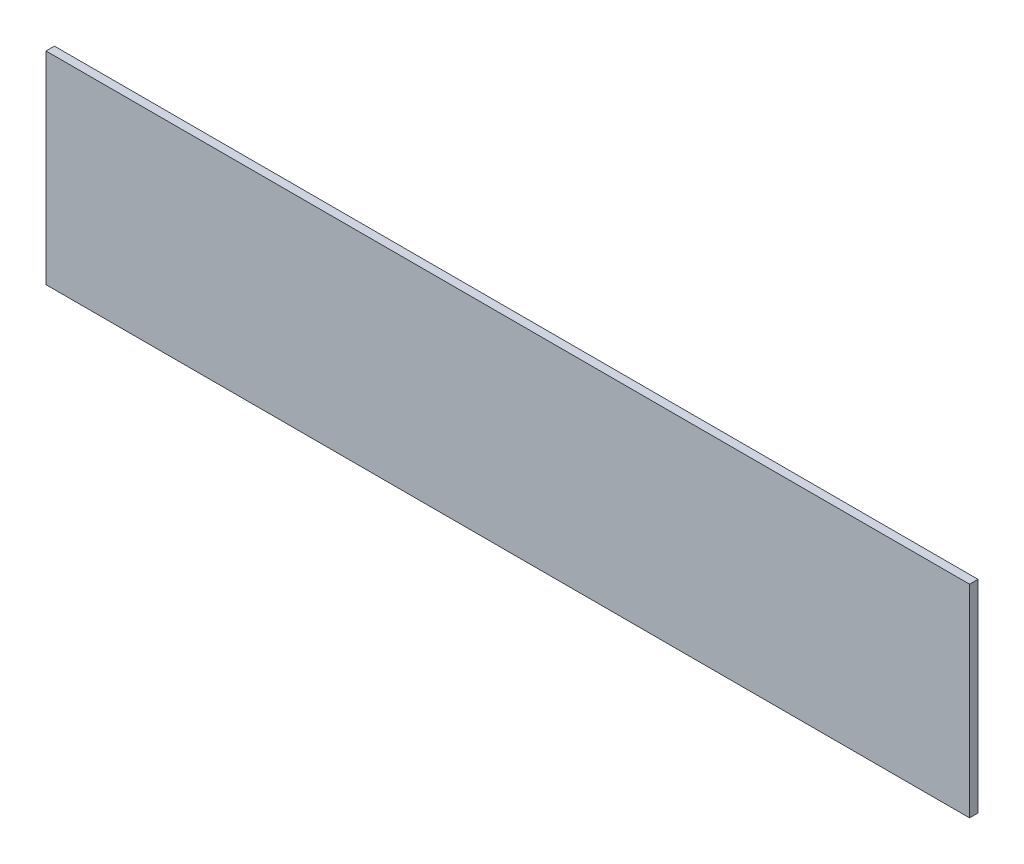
ISO-10303-21;
HEADER;
FILE_DESCRIPTION(('STEP AP214'),'2;1');
FILE_NAME('part.step','',(''),(''),'','','');
FILE_SCHEMA(('AUTOMOTIVE_DESIGN { 1 0 10303 214 1 1 1 1 }'));
ENDSEC;
DATA;
#1=APPLICATION_CONTEXT('core data for automotive mechanical design processes');
#2=APPLICATION_PROTOCOL_DEFINITION('international standard','automotive_design',2000,#1);
#3=PRODUCT_CONTEXT('',#1,'mechanical');
#4=PRODUCT('Part','Part','',(#3));
#5=PRODUCT_RELATED_PRODUCT_CATEGORY('part','',(#4));
#6=PRODUCT_DEFINITION_FORMATION('','',#4);
#7=PRODUCT_DEFINITION_CONTEXT('part definition',#1,'design');
#8=PRODUCT_DEFINITION('design','',#6,#7);
#9=PRODUCT_DEFINITION_SHAPE('','',#8);
#10=(LENGTH_UNIT() NAMED_UNIT(*) SI_UNIT(.MILLI.,.METRE.));
#11=(NAMED_UNIT(*) PLANE_ANGLE_UNIT() SI_UNIT($,.RADIAN.));
#12=(NAMED_UNIT(*) SI_UNIT($,.STERADIAN.) SOLID_ANGLE_UNIT());
#13=UNCERTAINTY_MEASURE_WITH_UNIT(LENGTH_MEASURE(1.E-05),#10,'distance_accuracy_value','');
#14=(GEOMETRIC_REPRESENTATION_CONTEXT(3) GLOBAL_UNCERTAINTY_ASSIGNED_CONTEXT((#13)) GLOBAL_UNIT_ASSIGNED_CONTEXT((#10,
#11,#12)) REPRESENTATION_CONTEXT('',''));
#15=CARTESIAN_POINT('',(0.,0.,0.));
#16=DIRECTION('',(0.,0.,1.));
#17=DIRECTION('',(1.,0.,0.));
#18=AXIS2_PLACEMENT_3D('',#15,#16,#17);
#19=CARTESIAN_POINT('',(0.,0.,6.00000000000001));
#20=DIRECTION('',(1.,0.,0.));
#21=DIRECTION('',(0.,0.,-1.));
#22=AXIS2_PLACEMENT_3D('',#19,#20,#21);
#23=PLANE('',#22);
#24=DIRECTION('',(0.,-1.,0.));
#25=VECTOR('',#24,1.);
#26=CARTESIAN_POINT('',(0.,0.,0.));
#27=LINE('',#26,#25);
#28=CARTESIAN_POINT('',(0.,144.,0.));
#29=VERTEX_POINT('',#28);
#30=CARTESIAN_POINT('',(0.,0.,0.));
#31=VERTEX_POINT('',#30);
#32=EDGE_CURVE('E85',#29,#31,#27,.T.);
#33=ORIENTED_EDGE('',*,*,#32,.T.);
#34=DIRECTION('',(0.,0.,-1.));
#35=VECTOR('',#34,1.);
#36=CARTESIAN_POINT('',(0.,0.,6.00000000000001));
#37=LINE('',#36,#35);
#38=CARTESIAN_POINT('',(0.,0.,6.00000000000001));
#39=VERTEX_POINT('',#38);
#40=EDGE_CURVE('E11',#39,#31,#37,.T.);
#41=ORIENTED_EDGE('',*,*,#40,.F.);
#42=DIRECTION('',(0.,-1.,0.));
#43=VECTOR('',#42,1.);
#44=CARTESIAN_POINT('',(0.,0.,6.00000000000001));
#45=LINE('',#44,#43);
#46=CARTESIAN_POINT('',(0.,144.,6.00000000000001));
#47=VERTEX_POINT('',#46);
#48=EDGE_CURVE('E103',#47,#39,#45,.T.);
#49=ORIENTED_EDGE('',*,*,#48,.F.);
#50=DIRECTION('',(0.,0.,-1.));
#51=VECTOR('',#50,1.);
#52=CARTESIAN_POINT('',(0.,144.,6.00000000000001));
#53=LINE('',#52,#51);
#54=EDGE_CURVE('E97',#47,#29,#53,.T.);
#55=ORIENTED_EDGE('',*,*,#54,.T.);
#56=EDGE_LOOP('',(#33,#41,#49,#55));
#57=FACE_BOUND('',#56,.T.);
#58=ADVANCED_FACE('F41',(#57),#23,.F.);
#59=CARTESIAN_POINT('',(0.,0.,6.00000000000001));
#60=DIRECTION('',(0.,1.,0.));
#61=DIRECTION('',(0.,0.,1.));
#62=AXIS2_PLACEMENT_3D('',#59,#60,#61);
#63=PLANE('',#62);
#64=DIRECTION('',(1.,0.,0.));
#65=VECTOR('',#64,1.);
#66=CARTESIAN_POINT('',(0.,0.,0.));
#67=LINE('',#66,#65);
#68=CARTESIAN_POINT('',(657.,0.,0.));
#69=VERTEX_POINT('',#68);
#70=EDGE_CURVE('E81',#31,#69,#67,.T.);
#71=ORIENTED_EDGE('',*,*,#70,.T.);
#72=DIRECTION('',(0.,0.,-1.));
#73=VECTOR('',#72,1.);
#74=CARTESIAN_POINT('',(657.,0.,6.00000000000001));
#75=LINE('',#74,#73);
#76=CARTESIAN_POINT('',(657.,0.,6.00000000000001));
#77=VERTEX_POINT('',#76);
#78=EDGE_CURVE('E48',#77,#69,#75,.T.);
#79=ORIENTED_EDGE('',*,*,#78,.F.);
#80=DIRECTION('',(1.,0.,0.));
#81=VECTOR('',#80,1.);
#82=CARTESIAN_POINT('',(0.,0.,6.00000000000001));
#83=LINE('',#82,#81);
#84=EDGE_CURVE('E93',#39,#77,#83,.T.);
#85=ORIENTED_EDGE('',*,*,#84,.F.);
#86=ORIENTED_EDGE('',*,*,#40,.T.);
#87=EDGE_LOOP('',(#71,#79,#85,#86));
#88=FACE_BOUND('',#87,.T.);
#89=ADVANCED_FACE('F92',(#88),#63,.F.);
#90=CARTESIAN_POINT('',(657.,0.,6.00000000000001));
#91=DIRECTION('',(-1.,0.,0.));
#92=DIRECTION('',(0.,0.,1.));
#93=AXIS2_PLACEMENT_3D('',#90,#91,#92);
#94=PLANE('',#93);
#95=DIRECTION('',(0.,1.,0.));
#96=VECTOR('',#95,1.);
#97=CARTESIAN_POINT('',(657.,0.,0.));
#98=LINE('',#97,#96);
#99=CARTESIAN_POINT('',(657.,144.,0.));
#100=VERTEX_POINT('',#99);
#101=EDGE_CURVE('E86',#69,#100,#98,.T.);
#102=ORIENTED_EDGE('',*,*,#101,.T.);
#103=DIRECTION('',(0.,0.,-1.));
#104=VECTOR('',#103,1.);
#105=CARTESIAN_POINT('',(657.,144.,6.00000000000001));
#106=LINE('',#105,#104);
#107=CARTESIAN_POINT('',(657.,144.,6.00000000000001));
#108=VERTEX_POINT('',#107);
#109=EDGE_CURVE('E109',#108,#100,#106,.T.);
#110=ORIENTED_EDGE('',*,*,#109,.F.);
#111=DIRECTION('',(0.,1.,0.));
#112=VECTOR('',#111,1.);
#113=CARTESIAN_POINT('',(657.,0.,6.00000000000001));
#114=LINE('',#113,#112);
#115=EDGE_CURVE('E60',#77,#108,#114,.T.);
#116=ORIENTED_EDGE('',*,*,#115,.F.);
#117=ORIENTED_EDGE('',*,*,#78,.T.);
#118=EDGE_LOOP('',(#102,#110,#116,#117));
#119=FACE_BOUND('',#118,.T.);
#120=ADVANCED_FACE('F112',(#119),#94,.F.);
#121=CARTESIAN_POINT('',(0.,144.,6.00000000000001));
#122=DIRECTION('',(0.,-1.,0.));
#123=DIRECTION('',(0.,0.,-1.));
#124=AXIS2_PLACEMENT_3D('',#121,#122,#123);
#125=PLANE('',#124);
#126=DIRECTION('',(-1.,0.,0.));
#127=VECTOR('',#126,1.);
#128=CARTESIAN_POINT('',(0.,144.,0.));
#129=LINE('',#128,#127);
#130=EDGE_CURVE('E101',#100,#29,#129,.T.);
#131=ORIENTED_EDGE('',*,*,#130,.T.);
#132=ORIENTED_EDGE('',*,*,#54,.F.);
#133=DIRECTION('',(-1.,0.,0.));
#134=VECTOR('',#133,1.);
#135=CARTESIAN_POINT('',(0.,144.,6.00000000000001));
#136=LINE('',#135,#134);
#137=EDGE_CURVE('E55',#108,#47,#136,.T.);
#138=ORIENTED_EDGE('',*,*,#137,.F.);
#139=ORIENTED_EDGE('',*,*,#109,.T.);
#140=EDGE_LOOP('',(#131,#132,#138,#139));
#141=FACE_BOUND('',#140,.T.);
#142=ADVANCED_FACE('F114',(#141),#125,.F.);
#143=CARTESIAN_POINT('',(0.,144.,6.00000000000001));
#144=DIRECTION('',(0.,0.,-1.));
#145=DIRECTION('',(-1.,0.,0.));
#146=AXIS2_PLACEMENT_3D('',#143,#144,#145);
#147=PLANE('',#146);
#148=ORIENTED_EDGE('',*,*,#48,.T.);
#149=ORIENTED_EDGE('',*,*,#84,.T.);
#150=ORIENTED_EDGE('',*,*,#115,.T.);
#151=ORIENTED_EDGE('',*,*,#137,.T.);
#152=EDGE_LOOP('',(#148,#149,#150,#151));
#153=FACE_BOUND('',#152,.T.);
#154=ADVANCED_FACE('F115',(#153),#147,.F.);
#155=CARTESIAN_POINT('',(0.,144.,0.));
#156=DIRECTION('',(0.,0.,-1.));
#157=DIRECTION('',(-1.,0.,0.));
#158=AXIS2_PLACEMENT_3D('',#155,#156,#157);
#159=PLANE('',#158);
#160=ORIENTED_EDGE('',*,*,#32,.F.);
#161=ORIENTED_EDGE('',*,*,#130,.F.);
#162=ORIENTED_EDGE('',*,*,#101,.F.);
#163=ORIENTED_EDGE('',*,*,#70,.F.);
#164=EDGE_LOOP('',(#160,#161,#162,#163));
#165=FACE_BOUND('',#164,.T.);
#166=ADVANCED_FACE('F82',(#165),#159,.T.);
#167=CLOSED_SHELL('',(#58,#89,#120,#142,#154,#166));
#168=MANIFOLD_SOLID_BREP('B2',#167);
#169=ADVANCED_BREP_SHAPE_REPRESENTATION('',(#18,#168),#14);
#170=SHAPE_DEFINITION_REPRESENTATION(#9,#169);
ENDSEC;
END-ISO-10303-21;
